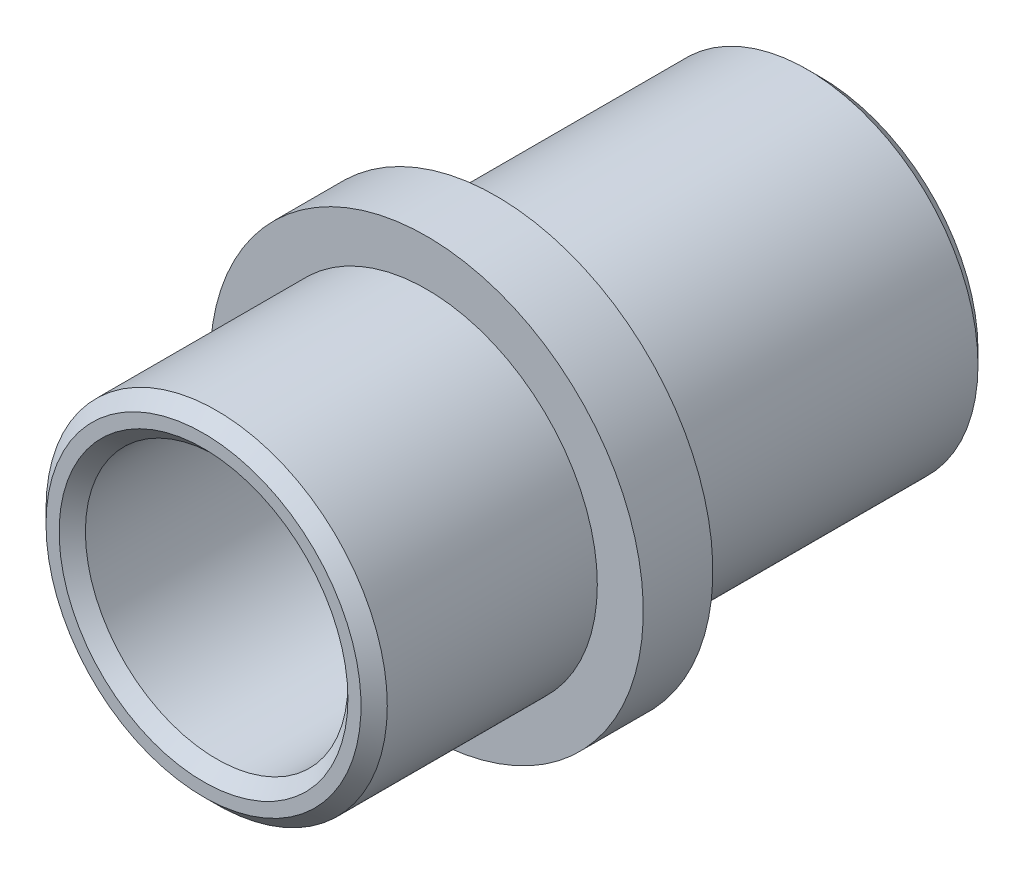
ISO-10303-21;
HEADER;
FILE_DESCRIPTION(('STEP AP214'),'2;1');
FILE_NAME('part.step','',(''),(''),'','','');
FILE_SCHEMA(('AUTOMOTIVE_DESIGN { 1 0 10303 214 1 1 1 1 }'));
ENDSEC;
DATA;
#1=APPLICATION_CONTEXT('core data for automotive mechanical design processes');
#2=APPLICATION_PROTOCOL_DEFINITION('international standard','automotive_design',2000,#1);
#3=PRODUCT_CONTEXT('',#1,'mechanical');
#4=PRODUCT('Part','Part','',(#3));
#5=PRODUCT_RELATED_PRODUCT_CATEGORY('part','',(#4));
#6=PRODUCT_DEFINITION_FORMATION('','',#4);
#7=PRODUCT_DEFINITION_CONTEXT('part definition',#1,'design');
#8=PRODUCT_DEFINITION('design','',#6,#7);
#9=PRODUCT_DEFINITION_SHAPE('','',#8);
#10=(LENGTH_UNIT() NAMED_UNIT(*) SI_UNIT(.MILLI.,.METRE.));
#11=(NAMED_UNIT(*) PLANE_ANGLE_UNIT() SI_UNIT($,.RADIAN.));
#12=(NAMED_UNIT(*) SI_UNIT($,.STERADIAN.) SOLID_ANGLE_UNIT());
#13=UNCERTAINTY_MEASURE_WITH_UNIT(LENGTH_MEASURE(1.E-05),#10,'distance_accuracy_value','');
#14=(GEOMETRIC_REPRESENTATION_CONTEXT(3) GLOBAL_UNCERTAINTY_ASSIGNED_CONTEXT((#13)) GLOBAL_UNIT_ASSIGNED_CONTEXT((#10,
#11,#12)) REPRESENTATION_CONTEXT('',''));
#15=CARTESIAN_POINT('',(0.,0.,0.));
#16=DIRECTION('',(0.,0.,1.));
#17=DIRECTION('',(1.,0.,0.));
#18=AXIS2_PLACEMENT_3D('',#15,#16,#17);
#19=CARTESIAN_POINT('',(6.93889390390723E-13,-8.13238365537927E-12,46.9999999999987));
#20=DIRECTION('',(0.,0.,-0.999999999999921));
#21=DIRECTION('',(-1.,0.,0.));
#22=AXIS2_PLACEMENT_3D('',#19,#20,#21);
#23=CYLINDRICAL_SURFACE('',#22,13.);
#24=CARTESIAN_POINT('',(5.55111512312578E-13,-9.71445146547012E-13,1.));
#25=DIRECTION('',(0.,0.,0.999999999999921));
#26=DIRECTION('',(1.,0.,0.));
#27=AXIS2_PLACEMENT_3D('',#24,#25,#26);
#28=CIRCLE('',#27,13.);
#29=CARTESIAN_POINT('',(-12.9999999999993,-8.15042477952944E-12,1.));
#30=VERTEX_POINT('',#29);
#31=EDGE_CURVE('E12',#30,#30,#28,.T.);
#32=CARTESIAN_POINT('',(1.74860126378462E-12,-4.7045700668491E-12,24.6999999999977));
#33=DIRECTION('',(0.,0.,0.999999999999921));
#34=DIRECTION('',(1.,0.,0.));
#35=AXIS2_PLACEMENT_3D('',#32,#33,#34);
#36=CIRCLE('',#35,13.);
#37=CARTESIAN_POINT('',(-12.9999999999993,-8.15042477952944E-12,24.6999999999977));
#38=VERTEX_POINT('',#37);
#39=EDGE_CURVE('E77',#38,#38,#36,.T.);
#40=CARTESIAN_POINT('',(-12.9999999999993,-8.15042477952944E-12,1.));
#41=CARTESIAN_POINT('',(-12.9999999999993,-8.15042477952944E-12,1.24687499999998));
#42=CARTESIAN_POINT('',(-12.9999999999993,-8.15042477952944E-12,1.49374999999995));
#43=CARTESIAN_POINT('',(-12.9999999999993,-8.15042477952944E-12,1.9874999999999));
#44=CARTESIAN_POINT('',(-12.9999999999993,-8.15042477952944E-12,2.23437499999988));
#45=CARTESIAN_POINT('',(-12.9999999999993,-8.15042477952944E-12,2.72812499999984));
#46=CARTESIAN_POINT('',(-12.9999999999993,-8.15042477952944E-12,2.97499999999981));
#47=CARTESIAN_POINT('',(-12.9999999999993,-8.15042477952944E-12,3.46874999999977));
#48=CARTESIAN_POINT('',(-12.9999999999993,-8.15042477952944E-12,3.71562499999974));
#49=CARTESIAN_POINT('',(-12.9999999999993,-8.15042477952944E-12,4.20937499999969));
#50=CARTESIAN_POINT('',(-12.9999999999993,-8.15042477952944E-12,4.45624999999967));
#51=CARTESIAN_POINT('',(-12.9999999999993,-8.15042477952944E-12,4.94999999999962));
#52=CARTESIAN_POINT('',(-12.9999999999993,-8.15042477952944E-12,5.19687499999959));
#53=CARTESIAN_POINT('',(-12.9999999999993,-8.15042477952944E-12,5.69062499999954));
#54=CARTESIAN_POINT('',(-12.9999999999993,-8.15042477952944E-12,5.93749999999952));
#55=CARTESIAN_POINT('',(-12.9999999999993,-8.15042477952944E-12,6.43124999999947));
#56=CARTESIAN_POINT('',(-12.9999999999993,-8.15042477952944E-12,6.67812499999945));
#57=CARTESIAN_POINT('',(-12.9999999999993,-8.15042477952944E-12,7.1718749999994));
#58=CARTESIAN_POINT('',(-12.9999999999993,-8.15042477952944E-12,7.41874999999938));
#59=CARTESIAN_POINT('',(-12.9999999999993,-8.15042477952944E-12,7.91249999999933));
#60=CARTESIAN_POINT('',(-12.9999999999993,-8.15042477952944E-12,8.15937499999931));
#61=CARTESIAN_POINT('',(-12.9999999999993,-8.15042477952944E-12,8.65312499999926));
#62=CARTESIAN_POINT('',(-12.9999999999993,-8.15042477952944E-12,8.89999999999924));
#63=CARTESIAN_POINT('',(-12.9999999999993,-8.15042477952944E-12,9.39374999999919));
#64=CARTESIAN_POINT('',(-12.9999999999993,-8.15042477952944E-12,9.64062499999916));
#65=CARTESIAN_POINT('',(-12.9999999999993,-8.15042477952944E-12,10.1343749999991));
#66=CARTESIAN_POINT('',(-12.9999999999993,-8.15042477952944E-12,10.3812499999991));
#67=CARTESIAN_POINT('',(-12.9999999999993,-8.15042477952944E-12,10.874999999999));
#68=CARTESIAN_POINT('',(-12.9999999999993,-8.15042477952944E-12,11.121874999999));
#69=CARTESIAN_POINT('',(-12.9999999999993,-8.15042477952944E-12,11.615624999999));
#70=CARTESIAN_POINT('',(-12.9999999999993,-8.15042477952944E-12,11.8624999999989));
#71=CARTESIAN_POINT('',(-12.9999999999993,-8.15042477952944E-12,12.3562499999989));
#72=CARTESIAN_POINT('',(-12.9999999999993,-8.15042477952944E-12,12.6031249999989));
#73=CARTESIAN_POINT('',(-12.9999999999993,-8.15042477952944E-12,13.0968749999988));
#74=CARTESIAN_POINT('',(-12.9999999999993,-8.15042477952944E-12,13.3437499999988));
#75=CARTESIAN_POINT('',(-12.9999999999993,-8.15042477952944E-12,13.8374999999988));
#76=CARTESIAN_POINT('',(-12.9999999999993,-8.15042477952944E-12,14.0843749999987));
#77=CARTESIAN_POINT('',(-12.9999999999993,-8.15042477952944E-12,14.5781249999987));
#78=CARTESIAN_POINT('',(-12.9999999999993,-8.15042477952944E-12,14.8249999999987));
#79=CARTESIAN_POINT('',(-12.9999999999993,-8.15042477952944E-12,15.3187499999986));
#80=CARTESIAN_POINT('',(-12.9999999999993,-8.15042477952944E-12,15.5656249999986));
#81=CARTESIAN_POINT('',(-12.9999999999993,-8.15042477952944E-12,16.0593749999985));
#82=CARTESIAN_POINT('',(-12.9999999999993,-8.15042477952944E-12,16.3062499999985));
#83=CARTESIAN_POINT('',(-12.9999999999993,-8.15042477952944E-12,16.7999999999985));
#84=CARTESIAN_POINT('',(-12.9999999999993,-8.15042477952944E-12,17.0468749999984));
#85=CARTESIAN_POINT('',(-12.9999999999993,-8.15042477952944E-12,17.5406249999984));
#86=CARTESIAN_POINT('',(-12.9999999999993,-8.15042477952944E-12,17.7874999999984));
#87=CARTESIAN_POINT('',(-12.9999999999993,-8.15042477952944E-12,18.2812499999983));
#88=CARTESIAN_POINT('',(-12.9999999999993,-8.15042477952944E-12,18.5281249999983));
#89=CARTESIAN_POINT('',(-12.9999999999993,-8.15042477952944E-12,19.0218749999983));
#90=CARTESIAN_POINT('',(-12.9999999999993,-8.15042477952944E-12,19.2687499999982));
#91=CARTESIAN_POINT('',(-12.9999999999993,-8.15042477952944E-12,19.7624999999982));
#92=CARTESIAN_POINT('',(-12.9999999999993,-8.15042477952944E-12,20.0093749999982));
#93=CARTESIAN_POINT('',(-12.9999999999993,-8.15042477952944E-12,20.5031249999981));
#94=CARTESIAN_POINT('',(-12.9999999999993,-8.15042477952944E-12,20.7499999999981));
#95=CARTESIAN_POINT('',(-12.9999999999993,-8.15042477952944E-12,21.243749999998));
#96=CARTESIAN_POINT('',(-12.9999999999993,-8.15042477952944E-12,21.490624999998));
#97=CARTESIAN_POINT('',(-12.9999999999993,-8.15042477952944E-12,21.984374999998));
#98=CARTESIAN_POINT('',(-12.9999999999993,-8.15042477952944E-12,22.2312499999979));
#99=CARTESIAN_POINT('',(-12.9999999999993,-8.15042477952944E-12,22.7249999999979));
#100=CARTESIAN_POINT('',(-12.9999999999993,-8.15042477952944E-12,22.9718749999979));
#101=CARTESIAN_POINT('',(-12.9999999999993,-8.15042477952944E-12,23.4656249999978));
#102=CARTESIAN_POINT('',(-12.9999999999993,-8.15042477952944E-12,23.7124999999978));
#103=CARTESIAN_POINT('',(-12.9999999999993,-8.15042477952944E-12,24.2062499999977));
#104=CARTESIAN_POINT('',(-12.9999999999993,-8.15042477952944E-12,24.4531249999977));
#105=CARTESIAN_POINT('',(-12.9999999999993,-8.15042477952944E-12,24.6999999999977));
#106=B_SPLINE_CURVE_WITH_KNOTS('',3,(#40,#41,#42,#43,#44,#45,#46,#47,#48,#49,#50,#51,#52,#53,
#54,#55,#56,#57,#58,#59,#60,#61,#62,#63,#64,#65,#66,#67,#68,#69,#70,#71,#72,#73,#74,#75,#76,#77,
#78,#79,#80,#81,#82,#83,#84,#85,#86,#87,#88,#89,#90,#91,#92,#93,#94,#95,#96,#97,#98,#99,#100,
#101,#102,#103,#104,#105),.UNSPECIFIED.,.F.,.F.,(4,2,2,2,2,2,2,2,2,2,2,2,2,2,2,2,2,2,2,2,2,2,2,
2,2,2,2,2,2,2,2,2,4),(0.,0.740624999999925,1.48124999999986,2.22187499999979,2.96249999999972,
3.70312499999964,4.44374999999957,5.1843749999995,5.92499999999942,6.66562499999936,
7.40624999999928,8.14687499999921,8.88749999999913,9.62812499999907,10.368749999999,
11.1093749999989,11.8499999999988,12.5906249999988,13.3312499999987,14.0718749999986,
14.8124999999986,15.5531249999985,16.2937499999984,17.0343749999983,17.7749999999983,
18.5156249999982,19.2562499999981,19.9968749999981,20.737499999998,21.4781249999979,
22.2187499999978,22.9593749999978,23.6999999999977),.UNSPECIFIED.);
#107=EDGE_CURVE('BSEAM45',#30,#38,#106,.T.);
#108=ORIENTED_EDGE('',*,*,#31,.T.);
#109=ORIENTED_EDGE('',*,*,#39,.F.);
#110=ORIENTED_EDGE('',*,*,#107,.T.);
#111=ORIENTED_EDGE('',*,*,#107,.F.);
#112=EDGE_LOOP('',(#108,#110,#109,#111));
#113=FACE_BOUND('',#112,.T.);
#114=ADVANCED_FACE('F45',(#113),#23,.T.);
#115=CARTESIAN_POINT('',(6.93889390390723E-13,-8.13238365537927E-12,46.9999999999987));
#116=DIRECTION('',(0.,0.,0.999999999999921));
#117=DIRECTION('',(1.,0.,0.));
#118=AXIS2_PLACEMENT_3D('',#115,#116,#117);
#119=PLANE('',#118);
#120=CARTESIAN_POINT('',(6.93889390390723E-13,-8.13238365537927E-12,46.9999999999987));
#121=DIRECTION('',(0.,0.,0.999999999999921));
#122=DIRECTION('',(1.,0.,0.));
#123=AXIS2_PLACEMENT_3D('',#120,#121,#122);
#124=CIRCLE('',#123,11.);
#125=CARTESIAN_POINT('',(11.0000000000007,-8.11711808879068E-12,46.9999999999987));
#126=VERTEX_POINT('',#125);
#127=EDGE_CURVE('E65',#126,#126,#124,.F.);
#128=ORIENTED_EDGE('',*,*,#127,.T.);
#129=EDGE_LOOP('',(#128));
#130=FACE_BOUND('',#129,.T.);
#131=CARTESIAN_POINT('',(6.93889390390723E-13,-8.13238365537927E-12,46.9999999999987));
#132=DIRECTION('',(0.,0.,0.999999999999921));
#133=DIRECTION('',(1.,0.,0.));
#134=AXIS2_PLACEMENT_3D('',#131,#132,#133);
#135=CIRCLE('',#134,12.);
#136=CARTESIAN_POINT('',(-11.9999999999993,-8.14903700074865E-12,46.9999999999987));
#137=VERTEX_POINT('',#136);
#138=EDGE_CURVE('E68',#137,#137,#135,.T.);
#139=ORIENTED_EDGE('',*,*,#138,.T.);
#140=EDGE_LOOP('',(#139));
#141=FACE_BOUND('',#140,.T.);
#142=ADVANCED_FACE('F100',(#130,#141),#119,.T.);
#143=CARTESIAN_POINT('',(0.,0.,0.));
#144=DIRECTION('',(0.,0.,0.999999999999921));
#145=DIRECTION('',(1.,0.,0.));
#146=AXIS2_PLACEMENT_3D('',#143,#144,#145);
#147=PLANE('',#146);
#148=CARTESIAN_POINT('',(0.,0.,0.));
#149=DIRECTION('',(0.,0.,0.999999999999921));
#150=DIRECTION('',(1.,0.,0.));
#151=AXIS2_PLACEMENT_3D('',#148,#149,#150);
#152=CIRCLE('',#151,11.);
#153=CARTESIAN_POINT('',(-11.,0.,0.));
#154=VERTEX_POINT('',#153);
#155=EDGE_CURVE('E52',#154,#154,#152,.T.);
#156=ORIENTED_EDGE('',*,*,#155,.T.);
#157=EDGE_LOOP('',(#156));
#158=FACE_BOUND('',#157,.T.);
#159=CARTESIAN_POINT('',(0.,0.,0.));
#160=DIRECTION('',(0.,0.,0.999999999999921));
#161=DIRECTION('',(1.,0.,0.));
#162=AXIS2_PLACEMENT_3D('',#159,#160,#161);
#163=CIRCLE('',#162,12.);
#164=CARTESIAN_POINT('',(12.0000000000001,0.,0.));
#165=VERTEX_POINT('',#164);
#166=EDGE_CURVE('E56',#165,#165,#163,.F.);
#167=ORIENTED_EDGE('',*,*,#166,.T.);
#168=EDGE_LOOP('',(#167));
#169=FACE_BOUND('',#168,.T.);
#170=ADVANCED_FACE('F104',(#158,#169),#147,.F.);
#171=CARTESIAN_POINT('',(1.55431223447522E-12,-8.1601392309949E-12,45.9999999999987));
#172=DIRECTION('',(0.,0.,0.999999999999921));
#173=DIRECTION('',(1.,0.,0.));
#174=AXIS2_PLACEMENT_3D('',#171,#172,#173);
#175=CIRCLE('',#174,13.);
#176=CARTESIAN_POINT('',(-12.9999999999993,-8.15042477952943E-12,45.9999999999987));
#177=VERTEX_POINT('',#176);
#178=EDGE_CURVE('E60',#177,#177,#175,.F.);
#179=CARTESIAN_POINT('',(2.91433543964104E-12,-7.13318293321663E-12,29.9999999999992));
#180=DIRECTION('',(0.,0.,0.999999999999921));
#181=DIRECTION('',(1.,0.,0.));
#182=AXIS2_PLACEMENT_3D('',#179,#180,#181);
#183=CIRCLE('',#182,13.);
#184=CARTESIAN_POINT('',(-12.9999999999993,-8.15042477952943E-12,29.9999999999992));
#185=VERTEX_POINT('',#184);
#186=EDGE_CURVE('E78',#185,#185,#183,.T.);
#187=CARTESIAN_POINT('',(-12.9999999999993,-8.15042477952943E-12,45.9999999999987));
#188=CARTESIAN_POINT('',(-12.9999999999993,-8.15042477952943E-12,45.833333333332));
#189=CARTESIAN_POINT('',(-12.9999999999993,-8.15042477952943E-12,45.6666666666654));
#190=CARTESIAN_POINT('',(-12.9999999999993,-8.15042477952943E-12,45.333333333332));
#191=CARTESIAN_POINT('',(-12.9999999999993,-8.15042477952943E-12,45.1666666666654));
#192=CARTESIAN_POINT('',(-12.9999999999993,-8.15042477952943E-12,44.8333333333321));
#193=CARTESIAN_POINT('',(-12.9999999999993,-8.15042477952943E-12,44.6666666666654));
#194=CARTESIAN_POINT('',(-12.9999999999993,-8.15042477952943E-12,44.3333333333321));
#195=CARTESIAN_POINT('',(-12.9999999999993,-8.15042477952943E-12,44.1666666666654));
#196=CARTESIAN_POINT('',(-12.9999999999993,-8.15042477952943E-12,43.8333333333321));
#197=CARTESIAN_POINT('',(-12.9999999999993,-8.15042477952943E-12,43.6666666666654));
#198=CARTESIAN_POINT('',(-12.9999999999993,-8.15042477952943E-12,43.3333333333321));
#199=CARTESIAN_POINT('',(-12.9999999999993,-8.15042477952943E-12,43.1666666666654));
#200=CARTESIAN_POINT('',(-12.9999999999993,-8.15042477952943E-12,42.8333333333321));
#201=CARTESIAN_POINT('',(-12.9999999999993,-8.15042477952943E-12,42.6666666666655));
#202=CARTESIAN_POINT('',(-12.9999999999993,-8.15042477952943E-12,42.3333333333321));
#203=CARTESIAN_POINT('',(-12.9999999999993,-8.15042477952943E-12,42.1666666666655));
#204=CARTESIAN_POINT('',(-12.9999999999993,-8.15042477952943E-12,41.8333333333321));
#205=CARTESIAN_POINT('',(-12.9999999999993,-8.15042477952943E-12,41.6666666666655));
#206=CARTESIAN_POINT('',(-12.9999999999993,-8.15042477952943E-12,41.3333333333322));
#207=CARTESIAN_POINT('',(-12.9999999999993,-8.15042477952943E-12,41.1666666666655));
#208=CARTESIAN_POINT('',(-12.9999999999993,-8.15042477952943E-12,40.8333333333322));
#209=CARTESIAN_POINT('',(-12.9999999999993,-8.15042477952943E-12,40.6666666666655));
#210=CARTESIAN_POINT('',(-12.9999999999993,-8.15042477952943E-12,40.3333333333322));
#211=CARTESIAN_POINT('',(-12.9999999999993,-8.15042477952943E-12,40.1666666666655));
#212=CARTESIAN_POINT('',(-12.9999999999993,-8.15042477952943E-12,39.8333333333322));
#213=CARTESIAN_POINT('',(-12.9999999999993,-8.15042477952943E-12,39.6666666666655));
#214=CARTESIAN_POINT('',(-12.9999999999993,-8.15042477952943E-12,39.3333333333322));
#215=CARTESIAN_POINT('',(-12.9999999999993,-8.15042477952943E-12,39.1666666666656));
#216=CARTESIAN_POINT('',(-12.9999999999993,-8.15042477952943E-12,38.8333333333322));
#217=CARTESIAN_POINT('',(-12.9999999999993,-8.15042477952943E-12,38.6666666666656));
#218=CARTESIAN_POINT('',(-12.9999999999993,-8.15042477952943E-12,38.3333333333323));
#219=CARTESIAN_POINT('',(-12.9999999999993,-8.15042477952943E-12,38.1666666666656));
#220=CARTESIAN_POINT('',(-12.9999999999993,-8.15042477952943E-12,37.8333333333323));
#221=CARTESIAN_POINT('',(-12.9999999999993,-8.15042477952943E-12,37.6666666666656));
#222=CARTESIAN_POINT('',(-12.9999999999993,-8.15042477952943E-12,37.3333333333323));
#223=CARTESIAN_POINT('',(-12.9999999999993,-8.15042477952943E-12,37.1666666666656));
#224=CARTESIAN_POINT('',(-12.9999999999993,-8.15042477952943E-12,36.8333333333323));
#225=CARTESIAN_POINT('',(-12.9999999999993,-8.15042477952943E-12,36.6666666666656));
#226=CARTESIAN_POINT('',(-12.9999999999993,-8.15042477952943E-12,36.3333333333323));
#227=CARTESIAN_POINT('',(-12.9999999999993,-8.15042477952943E-12,36.1666666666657));
#228=CARTESIAN_POINT('',(-12.9999999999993,-8.15042477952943E-12,35.8333333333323));
#229=CARTESIAN_POINT('',(-12.9999999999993,-8.15042477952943E-12,35.6666666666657));
#230=CARTESIAN_POINT('',(-12.9999999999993,-8.15042477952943E-12,35.3333333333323));
#231=CARTESIAN_POINT('',(-12.9999999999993,-8.15042477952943E-12,35.1666666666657));
#232=CARTESIAN_POINT('',(-12.9999999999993,-8.15042477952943E-12,34.8333333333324));
#233=CARTESIAN_POINT('',(-12.9999999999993,-8.15042477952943E-12,34.6666666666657));
#234=CARTESIAN_POINT('',(-12.9999999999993,-8.15042477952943E-12,34.3333333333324));
#235=CARTESIAN_POINT('',(-12.9999999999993,-8.15042477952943E-12,34.1666666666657));
#236=CARTESIAN_POINT('',(-12.9999999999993,-8.15042477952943E-12,33.8333333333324));
#237=CARTESIAN_POINT('',(-12.9999999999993,-8.15042477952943E-12,33.6666666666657));
#238=CARTESIAN_POINT('',(-12.9999999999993,-8.15042477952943E-12,33.3333333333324));
#239=CARTESIAN_POINT('',(-12.9999999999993,-8.15042477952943E-12,33.1666666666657));
#240=CARTESIAN_POINT('',(-12.9999999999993,-8.15042477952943E-12,32.8333333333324));
#241=CARTESIAN_POINT('',(-12.9999999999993,-8.15042477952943E-12,32.6666666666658));
#242=CARTESIAN_POINT('',(-12.9999999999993,-8.15042477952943E-12,32.3333333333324));
#243=CARTESIAN_POINT('',(-12.9999999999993,-8.15042477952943E-12,32.1666666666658));
#244=CARTESIAN_POINT('',(-12.9999999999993,-8.15042477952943E-12,31.8333333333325));
#245=CARTESIAN_POINT('',(-12.9999999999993,-8.15042477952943E-12,31.6666666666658));
#246=CARTESIAN_POINT('',(-12.9999999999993,-8.15042477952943E-12,31.3333333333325));
#247=CARTESIAN_POINT('',(-12.9999999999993,-8.15042477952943E-12,31.1666666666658));
#248=CARTESIAN_POINT('',(-12.9999999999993,-8.15042477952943E-12,30.8333333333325));
#249=CARTESIAN_POINT('',(-12.9999999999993,-8.15042477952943E-12,30.6666666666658));
#250=CARTESIAN_POINT('',(-12.9999999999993,-8.15042477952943E-12,30.3333333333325));
#251=CARTESIAN_POINT('',(-12.9999999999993,-8.15042477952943E-12,30.1666666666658));
#252=CARTESIAN_POINT('',(-12.9999999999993,-8.15042477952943E-12,29.9999999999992));
#253=B_SPLINE_CURVE_WITH_KNOTS('',3,(#187,#188,#189,#190,#191,#192,#193,#194,#195,#196,#197,
#198,#199,#200,#201,#202,#203,#204,#205,#206,#207,#208,#209,#210,#211,#212,#213,#214,#215,#216,
#217,#218,#219,#220,#221,#222,#223,#224,#225,#226,#227,#228,#229,#230,#231,#232,#233,#234,#235,
#236,#237,#238,#239,#240,#241,#242,#243,#244,#245,#246,#247,#248,#249,#250,#251,#252),
.UNSPECIFIED.,.F.,.F.,(4,2,2,2,2,2,2,2,2,2,2,2,2,2,2,2,2,2,2,2,2,2,2,2,2,2,2,2,2,2,2,2,4),(0.,
0.49999999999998,0.999999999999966,1.49999999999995,1.99999999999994,2.49999999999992,
2.99999999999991,3.49999999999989,3.99999999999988,4.49999999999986,4.99999999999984,
5.49999999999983,5.99999999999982,6.4999999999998,6.99999999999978,7.49999999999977,
7.99999999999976,8.49999999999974,8.99999999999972,9.49999999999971,9.9999999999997,
10.4999999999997,10.9999999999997,11.4999999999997,11.9999999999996,12.4999999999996,
12.9999999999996,13.4999999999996,13.9999999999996,14.4999999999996,14.9999999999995,
15.4999999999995,15.9999999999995),.UNSPECIFIED.);
#254=EDGE_CURVE('BSEAM47',#177,#185,#253,.T.);
#255=ORIENTED_EDGE('',*,*,#178,.T.);
#256=ORIENTED_EDGE('',*,*,#186,.T.);
#257=ORIENTED_EDGE('',*,*,#254,.T.);
#258=ORIENTED_EDGE('',*,*,#254,.F.);
#259=EDGE_LOOP('',(#255,#257,#256,#258));
#260=FACE_BOUND('',#259,.T.);
#261=ADVANCED_FACE('F47',(#260),#23,.T.);
#262=CARTESIAN_POINT('',(6.93889390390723E-13,-8.13238365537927E-12,46.9999999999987));
#263=DIRECTION('',(0.,0.,-0.999999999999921));
#264=DIRECTION('',(-1.,0.,0.));
#265=AXIS2_PLACEMENT_3D('',#262,#263,#264);
#266=CYLINDRICAL_SURFACE('',#265,10.);
#267=CARTESIAN_POINT('',(1.55431223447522E-12,-8.1601392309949E-12,45.9999999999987));
#268=DIRECTION('',(0.,0.,0.999999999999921));
#269=DIRECTION('',(1.,0.,0.));
#270=AXIS2_PLACEMENT_3D('',#267,#268,#269);
#271=CIRCLE('',#270,10.);
#272=CARTESIAN_POINT('',(-9.99999999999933,-8.14626144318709E-12,45.9999999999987));
#273=VERTEX_POINT('',#272);
#274=EDGE_CURVE('E71',#273,#273,#271,.T.);
#275=CARTESIAN_POINT('',(5.55111512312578E-13,-9.71445146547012E-13,1.));
#276=DIRECTION('',(0.,0.,0.999999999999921));
#277=DIRECTION('',(1.,0.,0.));
#278=AXIS2_PLACEMENT_3D('',#275,#276,#277);
#279=CIRCLE('',#278,10.);
#280=CARTESIAN_POINT('',(-9.99999999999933,-8.14626144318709E-12,1.));
#281=VERTEX_POINT('',#280);
#282=EDGE_CURVE('E74',#281,#281,#279,.F.);
#283=CARTESIAN_POINT('',(-9.99999999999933,-8.14626144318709E-12,45.9999999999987));
#284=CARTESIAN_POINT('',(-9.99999999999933,-8.14626144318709E-12,45.5312499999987));
#285=CARTESIAN_POINT('',(-9.99999999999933,-8.14626144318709E-12,45.0624999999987));
#286=CARTESIAN_POINT('',(-9.99999999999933,-8.14626144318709E-12,44.1249999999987));
#287=CARTESIAN_POINT('',(-9.99999999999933,-8.14626144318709E-12,43.6562499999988));
#288=CARTESIAN_POINT('',(-9.99999999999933,-8.14626144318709E-12,42.7187499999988));
#289=CARTESIAN_POINT('',(-9.99999999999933,-8.14626144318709E-12,42.2499999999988));
#290=CARTESIAN_POINT('',(-9.99999999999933,-8.14626144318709E-12,41.3124999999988));
#291=CARTESIAN_POINT('',(-9.99999999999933,-8.14626144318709E-12,40.8437499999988));
#292=CARTESIAN_POINT('',(-9.99999999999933,-8.14626144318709E-12,39.9062499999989));
#293=CARTESIAN_POINT('',(-9.99999999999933,-8.14626144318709E-12,39.4374999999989));
#294=CARTESIAN_POINT('',(-9.99999999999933,-8.14626144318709E-12,38.4999999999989));
#295=CARTESIAN_POINT('',(-9.99999999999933,-8.14626144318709E-12,38.0312499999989));
#296=CARTESIAN_POINT('',(-9.99999999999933,-8.14626144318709E-12,37.0937499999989));
#297=CARTESIAN_POINT('',(-9.99999999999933,-8.14626144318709E-12,36.624999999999));
#298=CARTESIAN_POINT('',(-9.99999999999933,-8.14626144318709E-12,35.687499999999));
#299=CARTESIAN_POINT('',(-9.99999999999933,-8.14626144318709E-12,35.218749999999));
#300=CARTESIAN_POINT('',(-9.99999999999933,-8.14626144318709E-12,34.281249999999));
#301=CARTESIAN_POINT('',(-9.99999999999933,-8.14626144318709E-12,33.812499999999));
#302=CARTESIAN_POINT('',(-9.99999999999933,-8.14626144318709E-12,32.8749999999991));
#303=CARTESIAN_POINT('',(-9.99999999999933,-8.14626144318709E-12,32.4062499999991));
#304=CARTESIAN_POINT('',(-9.99999999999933,-8.14626144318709E-12,31.4687499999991));
#305=CARTESIAN_POINT('',(-9.99999999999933,-8.14626144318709E-12,30.9999999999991));
#306=CARTESIAN_POINT('',(-9.99999999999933,-8.14626144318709E-12,30.0624999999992));
#307=CARTESIAN_POINT('',(-9.99999999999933,-8.14626144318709E-12,29.5937499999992));
#308=CARTESIAN_POINT('',(-9.99999999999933,-8.14626144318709E-12,28.6562499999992));
#309=CARTESIAN_POINT('',(-9.99999999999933,-8.14626144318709E-12,28.1874999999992));
#310=CARTESIAN_POINT('',(-9.99999999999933,-8.14626144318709E-12,27.2499999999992));
#311=CARTESIAN_POINT('',(-9.99999999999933,-8.14626144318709E-12,26.7812499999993));
#312=CARTESIAN_POINT('',(-9.99999999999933,-8.14626144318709E-12,25.8437499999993));
#313=CARTESIAN_POINT('',(-9.99999999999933,-8.14626144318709E-12,25.3749999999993));
#314=CARTESIAN_POINT('',(-9.99999999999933,-8.14626144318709E-12,24.4374999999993));
#315=CARTESIAN_POINT('',(-9.99999999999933,-8.14626144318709E-12,23.9687499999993));
#316=CARTESIAN_POINT('',(-9.99999999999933,-8.14626144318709E-12,23.0312499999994));
#317=CARTESIAN_POINT('',(-9.99999999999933,-8.14626144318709E-12,22.5624999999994));
#318=CARTESIAN_POINT('',(-9.99999999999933,-8.14626144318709E-12,21.6249999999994));
#319=CARTESIAN_POINT('',(-9.99999999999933,-8.14626144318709E-12,21.1562499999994));
#320=CARTESIAN_POINT('',(-9.99999999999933,-8.14626144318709E-12,20.2187499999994));
#321=CARTESIAN_POINT('',(-9.99999999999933,-8.14626144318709E-12,19.7499999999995));
#322=CARTESIAN_POINT('',(-9.99999999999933,-8.14626144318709E-12,18.8124999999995));
#323=CARTESIAN_POINT('',(-9.99999999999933,-8.14626144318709E-12,18.3437499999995));
#324=CARTESIAN_POINT('',(-9.99999999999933,-8.14626144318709E-12,17.4062499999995));
#325=CARTESIAN_POINT('',(-9.99999999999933,-8.14626144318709E-12,16.9374999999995));
#326=CARTESIAN_POINT('',(-9.99999999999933,-8.14626144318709E-12,15.9999999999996));
#327=CARTESIAN_POINT('',(-9.99999999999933,-8.14626144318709E-12,15.5312499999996));
#328=CARTESIAN_POINT('',(-9.99999999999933,-8.14626144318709E-12,14.5937499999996));
#329=CARTESIAN_POINT('',(-9.99999999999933,-8.14626144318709E-12,14.1249999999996));
#330=CARTESIAN_POINT('',(-9.99999999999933,-8.14626144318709E-12,13.1874999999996));
#331=CARTESIAN_POINT('',(-9.99999999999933,-8.14626144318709E-12,12.7187499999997));
#332=CARTESIAN_POINT('',(-9.99999999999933,-8.14626144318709E-12,11.7812499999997));
#333=CARTESIAN_POINT('',(-9.99999999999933,-8.14626144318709E-12,11.3124999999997));
#334=CARTESIAN_POINT('',(-9.99999999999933,-8.14626144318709E-12,10.3749999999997));
#335=CARTESIAN_POINT('',(-9.99999999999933,-8.14626144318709E-12,9.90624999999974));
#336=CARTESIAN_POINT('',(-9.99999999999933,-8.14626144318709E-12,8.96874999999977));
#337=CARTESIAN_POINT('',(-9.99999999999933,-8.14626144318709E-12,8.49999999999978));
#338=CARTESIAN_POINT('',(-9.99999999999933,-8.14626144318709E-12,7.56249999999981));
#339=CARTESIAN_POINT('',(-9.99999999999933,-8.14626144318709E-12,7.09374999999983));
#340=CARTESIAN_POINT('',(-9.99999999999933,-8.14626144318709E-12,6.15624999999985));
#341=CARTESIAN_POINT('',(-9.99999999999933,-8.14626144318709E-12,5.68749999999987));
#342=CARTESIAN_POINT('',(-9.99999999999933,-8.14626144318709E-12,4.7499999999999));
#343=CARTESIAN_POINT('',(-9.99999999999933,-8.14626144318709E-12,4.28124999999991));
#344=CARTESIAN_POINT('',(-9.99999999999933,-8.14626144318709E-12,3.34374999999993));
#345=CARTESIAN_POINT('',(-9.99999999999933,-8.14626144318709E-12,2.87499999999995));
#346=CARTESIAN_POINT('',(-9.99999999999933,-8.14626144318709E-12,1.93749999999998));
#347=CARTESIAN_POINT('',(-9.99999999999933,-8.14626144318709E-12,1.46874999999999));
#348=CARTESIAN_POINT('',(-9.99999999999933,-8.14626144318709E-12,1.));
#349=B_SPLINE_CURVE_WITH_KNOTS('',3,(#283,#284,#285,#286,#287,#288,#289,#290,#291,#292,#293,
#294,#295,#296,#297,#298,#299,#300,#301,#302,#303,#304,#305,#306,#307,#308,#309,#310,#311,#312,
#313,#314,#315,#316,#317,#318,#319,#320,#321,#322,#323,#324,#325,#326,#327,#328,#329,#330,#331,
#332,#333,#334,#335,#336,#337,#338,#339,#340,#341,#342,#343,#344,#345,#346,#347,#348),
.UNSPECIFIED.,.F.,.F.,(4,2,2,2,2,2,2,2,2,2,2,2,2,2,2,2,2,2,2,2,2,2,2,2,2,2,2,2,2,2,2,2,4),(0.,
1.40624999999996,2.81249999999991,4.21874999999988,5.62499999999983,7.03124999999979,
8.43749999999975,9.84374999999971,11.2499999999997,12.6562499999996,14.0624999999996,
15.4687499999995,16.8749999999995,18.2812499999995,19.6874999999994,21.0937499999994,
22.4999999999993,23.9062499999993,25.3124999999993,26.7187499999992,28.1249999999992,
29.5312499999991,30.9374999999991,32.3437499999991,33.749999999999,35.156249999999,
36.5624999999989,37.9687499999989,39.3749999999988,40.7812499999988,42.1874999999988,
43.5937499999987,44.9999999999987),.UNSPECIFIED.);
#350=EDGE_CURVE('BSEAM107',#273,#281,#349,.T.);
#351=ORIENTED_EDGE('',*,*,#274,.T.);
#352=ORIENTED_EDGE('',*,*,#282,.T.);
#353=ORIENTED_EDGE('',*,*,#350,.T.);
#354=ORIENTED_EDGE('',*,*,#350,.F.);
#355=EDGE_LOOP('',(#351,#353,#352,#354));
#356=FACE_BOUND('',#355,.T.);
#357=ADVANCED_FACE('F107',(#356),#266,.F.);
#358=CARTESIAN_POINT('',(2.91433543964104E-12,-7.13318293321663E-12,29.9999999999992));
#359=DIRECTION('',(0.,0.,0.999999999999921));
#360=DIRECTION('',(1.,0.,0.));
#361=AXIS2_PLACEMENT_3D('',#358,#359,#360);
#362=PLANE('',#361);
#363=CARTESIAN_POINT('',(2.91433543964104E-12,-7.13318293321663E-12,29.9999999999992));
#364=DIRECTION('',(0.,0.,0.999999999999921));
#365=DIRECTION('',(1.,0.,0.));
#366=AXIS2_PLACEMENT_3D('',#363,#364,#365);
#367=CIRCLE('',#366,16.5);
#368=CARTESIAN_POINT('',(-16.4999999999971,-7.15608128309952E-12,29.9999999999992));
#369=VERTEX_POINT('',#368);
#370=EDGE_CURVE('E81',#369,#369,#367,.T.);
#371=ORIENTED_EDGE('',*,*,#370,.T.);
#372=EDGE_LOOP('',(#371));
#373=FACE_BOUND('',#372,.T.);
#374=ORIENTED_EDGE('',*,*,#186,.F.);
#375=EDGE_LOOP('',(#374));
#376=FACE_BOUND('',#375,.T.);
#377=ADVANCED_FACE('F95',(#373,#376),#362,.T.);
#378=CARTESIAN_POINT('',(1.74860126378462E-12,-4.7045700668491E-12,24.6999999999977));
#379=DIRECTION('',(0.,0.,0.999999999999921));
#380=DIRECTION('',(1.,0.,0.));
#381=AXIS2_PLACEMENT_3D('',#378,#379,#380);
#382=PLANE('',#381);
#383=CARTESIAN_POINT('',(1.74860126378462E-12,-4.7045700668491E-12,24.6999999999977));
#384=DIRECTION('',(0.,0.,0.999999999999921));
#385=DIRECTION('',(1.,0.,0.));
#386=AXIS2_PLACEMENT_3D('',#383,#384,#385);
#387=CIRCLE('',#386,16.5);
#388=CARTESIAN_POINT('',(-16.4999999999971,-7.15608128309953E-12,24.6999999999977));
#389=VERTEX_POINT('',#388);
#390=EDGE_CURVE('E86',#389,#389,#387,.T.);
#391=ORIENTED_EDGE('',*,*,#390,.F.);
#392=EDGE_LOOP('',(#391));
#393=FACE_BOUND('',#392,.T.);
#394=ORIENTED_EDGE('',*,*,#39,.T.);
#395=EDGE_LOOP('',(#394));
#396=FACE_BOUND('',#395,.T.);
#397=ADVANCED_FACE('F92',(#393,#396),#382,.F.);
#398=CARTESIAN_POINT('',(2.91433543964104E-12,-7.13318293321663E-12,29.9999999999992));
#399=DIRECTION('',(0.,0.,-0.999999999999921));
#400=DIRECTION('',(-1.,0.,0.));
#401=AXIS2_PLACEMENT_3D('',#398,#399,#400);
#402=CYLINDRICAL_SURFACE('',#401,16.5);
#403=CARTESIAN_POINT('',(-16.4999999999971,-7.15608128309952E-12,29.9999999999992));
#404=CARTESIAN_POINT('',(-16.4999999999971,-7.15608128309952E-12,29.9447916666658));
#405=CARTESIAN_POINT('',(-16.4999999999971,-7.15608128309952E-12,29.8895833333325));
#406=CARTESIAN_POINT('',(-16.4999999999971,-7.15608128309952E-12,29.7791666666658));
#407=CARTESIAN_POINT('',(-16.4999999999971,-7.15608128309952E-12,29.7239583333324));
#408=CARTESIAN_POINT('',(-16.4999999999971,-7.15608128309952E-12,29.6135416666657));
#409=CARTESIAN_POINT('',(-16.4999999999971,-7.15608128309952E-12,29.5583333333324));
#410=CARTESIAN_POINT('',(-16.4999999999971,-7.15608128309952E-12,29.4479166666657));
#411=CARTESIAN_POINT('',(-16.4999999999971,-7.15608128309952E-12,29.3927083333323));
#412=CARTESIAN_POINT('',(-16.4999999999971,-7.15608128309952E-12,29.2822916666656));
#413=CARTESIAN_POINT('',(-16.4999999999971,-7.15608128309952E-12,29.2270833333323));
#414=CARTESIAN_POINT('',(-16.4999999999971,-7.15608128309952E-12,29.1166666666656));
#415=CARTESIAN_POINT('',(-16.4999999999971,-7.15608128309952E-12,29.0614583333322));
#416=CARTESIAN_POINT('',(-16.4999999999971,-7.15608128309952E-12,28.9510416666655));
#417=CARTESIAN_POINT('',(-16.4999999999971,-7.15608128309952E-12,28.8958333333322));
#418=CARTESIAN_POINT('',(-16.4999999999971,-7.15608128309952E-12,28.7854166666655));
#419=CARTESIAN_POINT('',(-16.4999999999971,-7.15608128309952E-12,28.7302083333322));
#420=CARTESIAN_POINT('',(-16.4999999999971,-7.15608128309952E-12,28.6197916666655));
#421=CARTESIAN_POINT('',(-16.4999999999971,-7.15608128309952E-12,28.5645833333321));
#422=CARTESIAN_POINT('',(-16.4999999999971,-7.15608128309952E-12,28.4541666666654));
#423=CARTESIAN_POINT('',(-16.4999999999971,-7.15608128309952E-12,28.3989583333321));
#424=CARTESIAN_POINT('',(-16.4999999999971,-7.15608128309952E-12,28.2885416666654));
#425=CARTESIAN_POINT('',(-16.4999999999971,-7.15608128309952E-12,28.233333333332));
#426=CARTESIAN_POINT('',(-16.4999999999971,-7.15608128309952E-12,28.1229166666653));
#427=CARTESIAN_POINT('',(-16.4999999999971,-7.15608128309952E-12,28.067708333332));
#428=CARTESIAN_POINT('',(-16.4999999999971,-7.15608128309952E-12,27.9572916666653));
#429=CARTESIAN_POINT('',(-16.4999999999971,-7.15608128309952E-12,27.9020833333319));
#430=CARTESIAN_POINT('',(-16.4999999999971,-7.15608128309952E-12,27.7916666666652));
#431=CARTESIAN_POINT('',(-16.4999999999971,-7.15608128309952E-12,27.7364583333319));
#432=CARTESIAN_POINT('',(-16.4999999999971,-7.15608128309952E-12,27.6260416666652));
#433=CARTESIAN_POINT('',(-16.4999999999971,-7.15608128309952E-12,27.5708333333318));
#434=CARTESIAN_POINT('',(-16.4999999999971,-7.15608128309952E-12,27.4604166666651));
#435=CARTESIAN_POINT('',(-16.4999999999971,-7.15608128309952E-12,27.4052083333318));
#436=CARTESIAN_POINT('',(-16.4999999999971,-7.15608128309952E-12,27.2947916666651));
#437=CARTESIAN_POINT('',(-16.4999999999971,-7.15608128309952E-12,27.2395833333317));
#438=CARTESIAN_POINT('',(-16.4999999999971,-7.15608128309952E-12,27.129166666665));
#439=CARTESIAN_POINT('',(-16.4999999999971,-7.15608128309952E-12,27.0739583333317));
#440=CARTESIAN_POINT('',(-16.4999999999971,-7.15608128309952E-12,26.963541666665));
#441=CARTESIAN_POINT('',(-16.4999999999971,-7.15608128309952E-12,26.9083333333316));
#442=CARTESIAN_POINT('',(-16.4999999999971,-7.15608128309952E-12,26.7979166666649));
#443=CARTESIAN_POINT('',(-16.4999999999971,-7.15608128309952E-12,26.7427083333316));
#444=CARTESIAN_POINT('',(-16.4999999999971,-7.15608128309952E-12,26.6322916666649));
#445=CARTESIAN_POINT('',(-16.4999999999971,-7.15608128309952E-12,26.5770833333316));
#446=CARTESIAN_POINT('',(-16.4999999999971,-7.15608128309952E-12,26.4666666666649));
#447=CARTESIAN_POINT('',(-16.4999999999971,-7.15608128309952E-12,26.4114583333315));
#448=CARTESIAN_POINT('',(-16.4999999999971,-7.15608128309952E-12,26.3010416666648));
#449=CARTESIAN_POINT('',(-16.4999999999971,-7.15608128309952E-12,26.2458333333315));
#450=CARTESIAN_POINT('',(-16.4999999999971,-7.15608128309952E-12,26.1354166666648));
#451=CARTESIAN_POINT('',(-16.4999999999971,-7.15608128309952E-12,26.0802083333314));
#452=CARTESIAN_POINT('',(-16.4999999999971,-7.15608128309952E-12,25.9697916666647));
#453=CARTESIAN_POINT('',(-16.4999999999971,-7.15608128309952E-12,25.9145833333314));
#454=CARTESIAN_POINT('',(-16.4999999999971,-7.15608128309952E-12,25.8041666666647));
#455=CARTESIAN_POINT('',(-16.4999999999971,-7.15608128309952E-12,25.7489583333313));
#456=CARTESIAN_POINT('',(-16.4999999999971,-7.15608128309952E-12,25.6385416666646));
#457=CARTESIAN_POINT('',(-16.4999999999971,-7.15608128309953E-12,25.5833333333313));
#458=CARTESIAN_POINT('',(-16.4999999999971,-7.15608128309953E-12,25.4729166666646));
#459=CARTESIAN_POINT('',(-16.4999999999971,-7.15608128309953E-12,25.4177083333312));
#460=CARTESIAN_POINT('',(-16.4999999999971,-7.15608128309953E-12,25.3072916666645));
#461=CARTESIAN_POINT('',(-16.4999999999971,-7.15608128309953E-12,25.2520833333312));
#462=CARTESIAN_POINT('',(-16.4999999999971,-7.15608128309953E-12,25.1416666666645));
#463=CARTESIAN_POINT('',(-16.4999999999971,-7.15608128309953E-12,25.0864583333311));
#464=CARTESIAN_POINT('',(-16.4999999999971,-7.15608128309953E-12,24.9760416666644));
#465=CARTESIAN_POINT('',(-16.4999999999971,-7.15608128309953E-12,24.9208333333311));
#466=CARTESIAN_POINT('',(-16.4999999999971,-7.15608128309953E-12,24.8104166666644));
#467=CARTESIAN_POINT('',(-16.4999999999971,-7.15608128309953E-12,24.755208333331));
#468=CARTESIAN_POINT('',(-16.4999999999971,-7.15608128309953E-12,24.6999999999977));
#469=B_SPLINE_CURVE_WITH_KNOTS('',3,(#403,#404,#405,#406,#407,#408,#409,#410,#411,#412,#413,
#414,#415,#416,#417,#418,#419,#420,#421,#422,#423,#424,#425,#426,#427,#428,#429,#430,#431,#432,
#433,#434,#435,#436,#437,#438,#439,#440,#441,#442,#443,#444,#445,#446,#447,#448,#449,#450,#451,
#452,#453,#454,#455,#456,#457,#458,#459,#460,#461,#462,#463,#464,#465,#466,#467,#468),
.UNSPECIFIED.,.F.,.F.,(4,2,2,2,2,2,2,2,2,2,2,2,2,2,2,2,2,2,2,2,2,2,2,2,2,2,2,2,2,2,2,2,4),(0.,
0.165625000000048,0.331250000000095,0.49687500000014,0.662500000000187,0.828125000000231,
0.993750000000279,1.15937500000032,1.32500000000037,1.49062500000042,1.65625000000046,
1.82187500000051,1.98750000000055,2.1531250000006,2.31875000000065,2.48437500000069,
2.65000000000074,2.81562500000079,2.98125000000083,3.14687500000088,3.31250000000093,
3.47812500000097,3.64375000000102,3.80937500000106,3.97500000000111,4.14062500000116,
4.3062500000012,4.47187500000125,4.63750000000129,4.80312500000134,4.96875000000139,
5.13437500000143,5.30000000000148),.UNSPECIFIED.);
#470=EDGE_CURVE('BSEAM90',#369,#389,#469,.T.);
#471=ORIENTED_EDGE('',*,*,#370,.F.);
#472=ORIENTED_EDGE('',*,*,#390,.T.);
#473=ORIENTED_EDGE('',*,*,#470,.T.);
#474=ORIENTED_EDGE('',*,*,#470,.F.);
#475=EDGE_LOOP('',(#471,#473,#472,#474));
#476=FACE_BOUND('',#475,.T.);
#477=ADVANCED_FACE('F90',(#476),#402,.T.);
#478=CARTESIAN_POINT('',(1.55431223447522E-12,-8.1601392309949E-12,45.9999999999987));
#479=DIRECTION('',(0.,0.,0.999999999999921));
#480=DIRECTION('',(1.,0.,0.));
#481=AXIS2_PLACEMENT_3D('',#478,#479,#480);
#482=CONICAL_SURFACE('',#481,10.,0.785398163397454);
#483=ORIENTED_EDGE('',*,*,#127,.F.);
#484=EDGE_LOOP('',(#483));
#485=FACE_BOUND('',#484,.T.);
#486=ORIENTED_EDGE('',*,*,#274,.F.);
#487=EDGE_LOOP('',(#486));
#488=FACE_BOUND('',#487,.T.);
#489=ADVANCED_FACE('F128',(#485,#488),#482,.F.);
#490=CARTESIAN_POINT('',(6.93889390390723E-13,-8.13238365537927E-12,46.9999999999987));
#491=DIRECTION('',(0.,0.,-0.999999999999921));
#492=DIRECTION('',(-1.,0.,0.));
#493=AXIS2_PLACEMENT_3D('',#490,#491,#492);
#494=CONICAL_SURFACE('',#493,12.,0.785398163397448);
#495=CARTESIAN_POINT('',(-12.9999999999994,-8.15042477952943E-12,45.9999999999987));
#496=CARTESIAN_POINT('',(-12.9895833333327,-8.15041032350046E-12,46.0104166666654));
#497=CARTESIAN_POINT('',(-12.9791666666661,-8.1503958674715E-12,46.020833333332));
#498=CARTESIAN_POINT('',(-12.9583333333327,-8.15036695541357E-12,46.0416666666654));
#499=CARTESIAN_POINT('',(-12.9479166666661,-8.1503524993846E-12,46.052083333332));
#500=CARTESIAN_POINT('',(-12.9270833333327,-8.15032358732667E-12,46.0729166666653));
#501=CARTESIAN_POINT('',(-12.9166666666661,-8.1503091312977E-12,46.083333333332));
#502=CARTESIAN_POINT('',(-12.8958333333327,-8.15028021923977E-12,46.1041666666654));
#503=CARTESIAN_POINT('',(-12.8854166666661,-8.1502657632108E-12,46.114583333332));
#504=CARTESIAN_POINT('',(-12.8645833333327,-8.15023685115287E-12,46.1354166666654));
#505=CARTESIAN_POINT('',(-12.8541666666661,-8.1502223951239E-12,46.145833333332));
#506=CARTESIAN_POINT('',(-12.8333333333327,-8.15019348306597E-12,46.1666666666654));
#507=CARTESIAN_POINT('',(-12.8229166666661,-8.150179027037E-12,46.177083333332));
#508=CARTESIAN_POINT('',(-12.8020833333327,-8.15015011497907E-12,46.1979166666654));
#509=CARTESIAN_POINT('',(-12.7916666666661,-8.1501356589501E-12,46.208333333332));
#510=CARTESIAN_POINT('',(-12.7708333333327,-8.15010674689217E-12,46.2291666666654));
#511=CARTESIAN_POINT('',(-12.7604166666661,-8.1500922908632E-12,46.239583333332));
#512=CARTESIAN_POINT('',(-12.7395833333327,-8.15006337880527E-12,46.2604166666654));
#513=CARTESIAN_POINT('',(-12.7291666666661,-8.1500489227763E-12,46.270833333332));
#514=CARTESIAN_POINT('',(-12.7083333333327,-8.15002001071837E-12,46.2916666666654));
#515=CARTESIAN_POINT('',(-12.697916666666,-8.1500055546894E-12,46.302083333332));
#516=CARTESIAN_POINT('',(-12.6770833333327,-8.14997664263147E-12,46.3229166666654));
#517=CARTESIAN_POINT('',(-12.666666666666,-8.1499621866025E-12,46.333333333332));
#518=CARTESIAN_POINT('',(-12.6458333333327,-8.14993327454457E-12,46.3541666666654));
#519=CARTESIAN_POINT('',(-12.635416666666,-8.1499188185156E-12,46.364583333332));
#520=CARTESIAN_POINT('',(-12.6145833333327,-8.14988990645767E-12,46.3854166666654));
#521=CARTESIAN_POINT('',(-12.604166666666,-8.1498754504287E-12,46.395833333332));
#522=CARTESIAN_POINT('',(-12.5833333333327,-8.14984653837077E-12,46.4166666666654));
#523=CARTESIAN_POINT('',(-12.572916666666,-8.1498320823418E-12,46.427083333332));
#524=CARTESIAN_POINT('',(-12.5520833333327,-8.14980317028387E-12,46.4479166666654));
#525=CARTESIAN_POINT('',(-12.541666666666,-8.14978871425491E-12,46.458333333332));
#526=CARTESIAN_POINT('',(-12.5208333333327,-8.14975980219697E-12,46.4791666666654));
#527=CARTESIAN_POINT('',(-12.510416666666,-8.14974534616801E-12,46.489583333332));
#528=CARTESIAN_POINT('',(-12.4895833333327,-8.14971643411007E-12,46.5104166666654));
#529=CARTESIAN_POINT('',(-12.479166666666,-8.14970197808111E-12,46.520833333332));
#530=CARTESIAN_POINT('',(-12.4583333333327,-8.14967306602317E-12,46.5416666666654));
#531=CARTESIAN_POINT('',(-12.447916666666,-8.14965860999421E-12,46.552083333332));
#532=CARTESIAN_POINT('',(-12.4270833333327,-8.14962969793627E-12,46.5729166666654));
#533=CARTESIAN_POINT('',(-12.416666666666,-8.14961524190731E-12,46.583333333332));
#534=CARTESIAN_POINT('',(-12.3958333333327,-8.14958632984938E-12,46.6041666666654));
#535=CARTESIAN_POINT('',(-12.385416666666,-8.14957187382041E-12,46.614583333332));
#536=CARTESIAN_POINT('',(-12.3645833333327,-8.14954296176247E-12,46.6354166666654));
#537=CARTESIAN_POINT('',(-12.354166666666,-8.14952850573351E-12,46.645833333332));
#538=CARTESIAN_POINT('',(-12.3333333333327,-8.14949959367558E-12,46.6666666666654));
#539=CARTESIAN_POINT('',(-12.322916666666,-8.14948513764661E-12,46.677083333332));
#540=CARTESIAN_POINT('',(-12.3020833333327,-8.14945622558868E-12,46.6979166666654));
#541=CARTESIAN_POINT('',(-12.291666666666,-8.14944176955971E-12,46.708333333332));
#542=CARTESIAN_POINT('',(-12.2708333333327,-8.14941285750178E-12,46.7291666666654));
#543=CARTESIAN_POINT('',(-12.260416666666,-8.14939840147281E-12,46.739583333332));
#544=CARTESIAN_POINT('',(-12.2395833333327,-8.14936948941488E-12,46.7604166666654));
#545=CARTESIAN_POINT('',(-12.229166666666,-8.14935503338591E-12,46.770833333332));
#546=CARTESIAN_POINT('',(-12.2083333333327,-8.14932612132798E-12,46.7916666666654));
#547=CARTESIAN_POINT('',(-12.197916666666,-8.14931166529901E-12,46.802083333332));
#548=CARTESIAN_POINT('',(-12.1770833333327,-8.14928275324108E-12,46.8229166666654));
#549=CARTESIAN_POINT('',(-12.166666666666,-8.14926829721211E-12,46.833333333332));
#550=CARTESIAN_POINT('',(-12.1458333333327,-8.14923938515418E-12,46.8541666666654));
#551=CARTESIAN_POINT('',(-12.135416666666,-8.14922492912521E-12,46.864583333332));
#552=CARTESIAN_POINT('',(-12.1145833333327,-8.14919601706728E-12,46.8854166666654));
#553=CARTESIAN_POINT('',(-12.104166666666,-8.14918156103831E-12,46.895833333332));
#554=CARTESIAN_POINT('',(-12.0833333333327,-8.14915264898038E-12,46.9166666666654));
#555=CARTESIAN_POINT('',(-12.072916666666,-8.14913819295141E-12,46.927083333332));
#556=CARTESIAN_POINT('',(-12.0520833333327,-8.14910928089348E-12,46.9479166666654));
#557=CARTESIAN_POINT('',(-12.041666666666,-8.14909482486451E-12,46.958333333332));
#558=CARTESIAN_POINT('',(-12.0208333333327,-8.14906591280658E-12,46.9791666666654));
#559=CARTESIAN_POINT('',(-12.010416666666,-8.14905145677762E-12,46.989583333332));
#560=CARTESIAN_POINT('',(-11.9999999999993,-8.14903700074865E-12,46.9999999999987));
#561=B_SPLINE_CURVE_WITH_KNOTS('',3,(#495,#496,#497,#498,#499,#500,#501,#502,#503,#504,#505,
#506,#507,#508,#509,#510,#511,#512,#513,#514,#515,#516,#517,#518,#519,#520,#521,#522,#523,#524,
#525,#526,#527,#528,#529,#530,#531,#532,#533,#534,#535,#536,#537,#538,#539,#540,#541,#542,#543,
#544,#545,#546,#547,#548,#549,#550,#551,#552,#553,#554,#555,#556,#557,#558,#559,#560),
.UNSPECIFIED.,.F.,.F.,(4,2,2,2,2,2,2,2,2,2,2,2,2,2,2,2,2,2,2,2,2,2,2,2,2,2,2,2,2,2,2,2,4),(0.,
0.0441941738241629,0.0883883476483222,0.132582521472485,0.176776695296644,0.220970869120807,
0.265165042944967,0.309359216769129,0.353553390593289,0.397747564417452,0.44194173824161,
0.486135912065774,0.530330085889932,0.574524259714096,0.618718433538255,0.66291260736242,
0.707106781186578,0.751300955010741,0.7954951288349,0.839689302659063,0.883883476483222,
0.928077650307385,0.972271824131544,1.01646599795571,1.06066017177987,1.10485434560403,
1.14904851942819,1.19324269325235,1.23743686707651,1.28163104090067,1.32582521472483,
1.370019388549,1.41421356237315),.UNSPECIFIED.);
#562=EDGE_CURVE('BSEAM133',#177,#137,#561,.T.);
#563=ORIENTED_EDGE('',*,*,#178,.F.);
#564=ORIENTED_EDGE('',*,*,#138,.F.);
#565=ORIENTED_EDGE('',*,*,#562,.T.);
#566=ORIENTED_EDGE('',*,*,#562,.F.);
#567=EDGE_LOOP('',(#563,#565,#564,#566));
#568=FACE_BOUND('',#567,.T.);
#569=ADVANCED_FACE('F133',(#568),#494,.T.);
#570=CARTESIAN_POINT('',(0.,0.,0.));
#571=DIRECTION('',(0.,0.,-0.999999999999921));
#572=DIRECTION('',(-1.,0.,0.));
#573=AXIS2_PLACEMENT_3D('',#570,#571,#572);
#574=CONICAL_SURFACE('',#573,11.,0.785398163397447);
#575=CARTESIAN_POINT('',(-9.99999999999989,0.,1.));
#576=CARTESIAN_POINT('',(-10.0104166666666,0.,0.989583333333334));
#577=CARTESIAN_POINT('',(-10.0208333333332,0.,0.979166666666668));
#578=CARTESIAN_POINT('',(-10.0416666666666,0.,0.958333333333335));
#579=CARTESIAN_POINT('',(-10.0520833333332,0.,0.947916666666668));
#580=CARTESIAN_POINT('',(-10.0729166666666,0.,0.927083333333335));
#581=CARTESIAN_POINT('',(-10.0833333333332,0.,0.916666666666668));
#582=CARTESIAN_POINT('',(-10.1041666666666,0.,0.895833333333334));
#583=CARTESIAN_POINT('',(-10.1145833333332,0.,0.885416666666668));
#584=CARTESIAN_POINT('',(-10.1354166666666,0.,0.864583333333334));
#585=CARTESIAN_POINT('',(-10.1458333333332,0.,0.854166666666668));
#586=CARTESIAN_POINT('',(-10.1666666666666,0.,0.833333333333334));
#587=CARTESIAN_POINT('',(-10.1770833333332,0.,0.822916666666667));
#588=CARTESIAN_POINT('',(-10.1979166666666,0.,0.802083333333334));
#589=CARTESIAN_POINT('',(-10.2083333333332,0.,0.791666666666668));
#590=CARTESIAN_POINT('',(-10.2291666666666,0.,0.770833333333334));
#591=CARTESIAN_POINT('',(-10.2395833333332,0.,0.760416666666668));
#592=CARTESIAN_POINT('',(-10.2604166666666,0.,0.739583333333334));
#593=CARTESIAN_POINT('',(-10.2708333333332,0.,0.729166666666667));
#594=CARTESIAN_POINT('',(-10.2916666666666,0.,0.708333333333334));
#595=CARTESIAN_POINT('',(-10.3020833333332,0.,0.697916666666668));
#596=CARTESIAN_POINT('',(-10.3229166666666,0.,0.677083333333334));
#597=CARTESIAN_POINT('',(-10.3333333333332,0.,0.666666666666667));
#598=CARTESIAN_POINT('',(-10.3541666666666,0.,0.645833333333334));
#599=CARTESIAN_POINT('',(-10.3645833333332,0.,0.635416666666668));
#600=CARTESIAN_POINT('',(-10.3854166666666,0.,0.614583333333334));
#601=CARTESIAN_POINT('',(-10.3958333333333,0.,0.604166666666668));
#602=CARTESIAN_POINT('',(-10.4166666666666,0.,0.583333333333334));
#603=CARTESIAN_POINT('',(-10.4270833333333,0.,0.572916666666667));
#604=CARTESIAN_POINT('',(-10.4479166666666,0.,0.552083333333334));
#605=CARTESIAN_POINT('',(-10.4583333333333,0.,0.541666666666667));
#606=CARTESIAN_POINT('',(-10.4791666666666,0.,0.520833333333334));
#607=CARTESIAN_POINT('',(-10.4895833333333,0.,0.510416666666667));
#608=CARTESIAN_POINT('',(-10.5104166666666,0.,0.489583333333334));
#609=CARTESIAN_POINT('',(-10.5208333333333,0.,0.479166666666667));
#610=CARTESIAN_POINT('',(-10.5416666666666,0.,0.458333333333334));
#611=CARTESIAN_POINT('',(-10.5520833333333,0.,0.447916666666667));
#612=CARTESIAN_POINT('',(-10.5729166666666,0.,0.427083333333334));
#613=CARTESIAN_POINT('',(-10.5833333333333,0.,0.416666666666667));
#614=CARTESIAN_POINT('',(-10.6041666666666,0.,0.395833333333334));
#615=CARTESIAN_POINT('',(-10.6145833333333,0.,0.385416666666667));
#616=CARTESIAN_POINT('',(-10.6354166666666,0.,0.364583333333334));
#617=CARTESIAN_POINT('',(-10.6458333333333,0.,0.354166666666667));
#618=CARTESIAN_POINT('',(-10.6666666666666,0.,0.333333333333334));
#619=CARTESIAN_POINT('',(-10.6770833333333,0.,0.322916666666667));
#620=CARTESIAN_POINT('',(-10.6979166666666,0.,0.302083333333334));
#621=CARTESIAN_POINT('',(-10.7083333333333,0.,0.291666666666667));
#622=CARTESIAN_POINT('',(-10.7291666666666,0.,0.270833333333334));
#623=CARTESIAN_POINT('',(-10.7395833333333,0.,0.260416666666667));
#624=CARTESIAN_POINT('',(-10.7604166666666,0.,0.239583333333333));
#625=CARTESIAN_POINT('',(-10.7708333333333,0.,0.229166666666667));
#626=CARTESIAN_POINT('',(-10.7916666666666,0.,0.208333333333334));
#627=CARTESIAN_POINT('',(-10.8020833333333,0.,0.197916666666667));
#628=CARTESIAN_POINT('',(-10.8229166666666,0.,0.177083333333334));
#629=CARTESIAN_POINT('',(-10.8333333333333,0.,0.166666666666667));
#630=CARTESIAN_POINT('',(-10.8541666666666,0.,0.145833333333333));
#631=CARTESIAN_POINT('',(-10.8645833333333,0.,0.135416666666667));
#632=CARTESIAN_POINT('',(-10.8854166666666,0.,0.114583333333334));
#633=CARTESIAN_POINT('',(-10.8958333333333,0.,0.104166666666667));
#634=CARTESIAN_POINT('',(-10.9166666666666,0.,0.0833333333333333));
#635=CARTESIAN_POINT('',(-10.9270833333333,0.,0.0729166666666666));
#636=CARTESIAN_POINT('',(-10.9479166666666,0.,0.0520833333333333));
#637=CARTESIAN_POINT('',(-10.9583333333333,0.,0.0416666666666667));
#638=CARTESIAN_POINT('',(-10.9791666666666,0.,0.0208333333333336));
#639=CARTESIAN_POINT('',(-10.9895833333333,0.,0.0104166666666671));
#640=CARTESIAN_POINT('',(-11.,0.,0.));
#641=B_SPLINE_CURVE_WITH_KNOTS('',3,(#575,#576,#577,#578,#579,#580,#581,#582,#583,#584,#585,
#586,#587,#588,#589,#590,#591,#592,#593,#594,#595,#596,#597,#598,#599,#600,#601,#602,#603,#604,
#605,#606,#607,#608,#609,#610,#611,#612,#613,#614,#615,#616,#617,#618,#619,#620,#621,#622,#623,
#624,#625,#626,#627,#628,#629,#630,#631,#632,#633,#634,#635,#636,#637,#638,#639,#640),
.UNSPECIFIED.,.F.,.F.,(4,2,2,2,2,2,2,2,2,2,2,2,2,2,2,2,2,2,2,2,2,2,2,2,2,2,2,2,2,2,2,2,4),(0.,
0.0441941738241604,0.0883883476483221,0.132582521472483,0.176776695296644,0.220970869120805,
0.265165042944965,0.309359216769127,0.353553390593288,0.397747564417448,0.44194173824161,
0.48613591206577,0.530330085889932,0.574524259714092,0.618718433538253,0.662912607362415,
0.707106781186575,0.751300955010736,0.795495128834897,0.839689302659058,0.883883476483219,
0.92807765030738,0.97227182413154,1.0164659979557,1.06066017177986,1.10485434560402,
1.14904851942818,1.19324269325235,1.23743686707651,1.28163104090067,1.32582521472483,
1.37001938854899,1.41421356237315),.UNSPECIFIED.);
#642=EDGE_CURVE('BSEAM139',#281,#154,#641,.T.);
#643=ORIENTED_EDGE('',*,*,#282,.F.);
#644=ORIENTED_EDGE('',*,*,#155,.F.);
#645=ORIENTED_EDGE('',*,*,#642,.T.);
#646=ORIENTED_EDGE('',*,*,#642,.F.);
#647=EDGE_LOOP('',(#643,#645,#644,#646));
#648=FACE_BOUND('',#647,.T.);
#649=ADVANCED_FACE('F139',(#648),#574,.F.);
#650=CARTESIAN_POINT('',(5.55111512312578E-13,-9.71445146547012E-13,1.));
#651=DIRECTION('',(0.,0.,0.999999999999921));
#652=DIRECTION('',(1.,0.,0.));
#653=AXIS2_PLACEMENT_3D('',#650,#651,#652);
#654=CONICAL_SURFACE('',#653,13.,0.78539816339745);
#655=ORIENTED_EDGE('',*,*,#166,.F.);
#656=EDGE_LOOP('',(#655));
#657=FACE_BOUND('',#656,.T.);
#658=ORIENTED_EDGE('',*,*,#31,.F.);
#659=EDGE_LOOP('',(#658));
#660=FACE_BOUND('',#659,.T.);
#661=ADVANCED_FACE('F147',(#657,#660),#654,.T.);
#662=CLOSED_SHELL('',(#114,#142,#170,#261,#357,#377,#397,#477,#489,#569,#649,#661));
#663=MANIFOLD_SOLID_BREP('B2',#662);
#664=ADVANCED_BREP_SHAPE_REPRESENTATION('',(#18,#663),#14);
#665=SHAPE_DEFINITION_REPRESENTATION(#9,#664);
ENDSEC;
END-ISO-10303-21;
